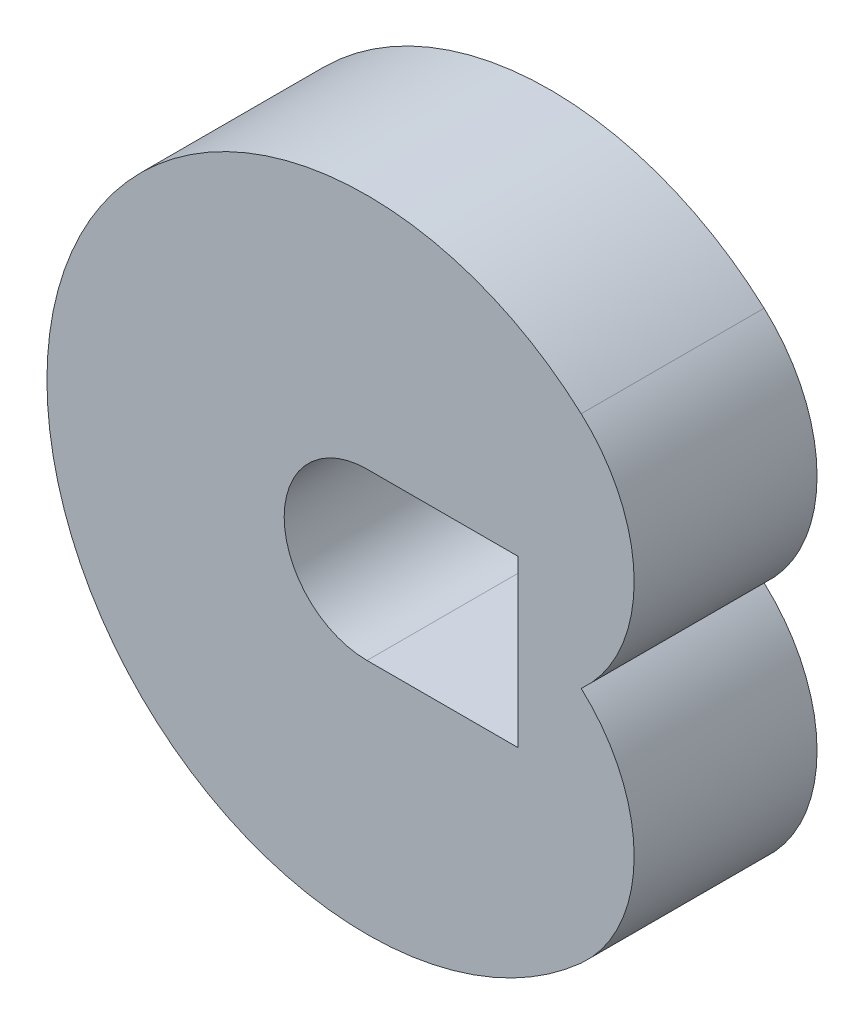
ISO-10303-21;
HEADER;
FILE_DESCRIPTION(('STEP AP214'),'2;1');
FILE_NAME('part.step','',(''),(''),'','','');
FILE_SCHEMA(('AUTOMOTIVE_DESIGN { 1 0 10303 214 1 1 1 1 }'));
ENDSEC;
DATA;
#1=APPLICATION_CONTEXT('core data for automotive mechanical design processes');
#2=APPLICATION_PROTOCOL_DEFINITION('international standard','automotive_design',2000,#1);
#3=PRODUCT_CONTEXT('',#1,'mechanical');
#4=PRODUCT('Part','Part','',(#3));
#5=PRODUCT_RELATED_PRODUCT_CATEGORY('part','',(#4));
#6=PRODUCT_DEFINITION_FORMATION('','',#4);
#7=PRODUCT_DEFINITION_CONTEXT('part definition',#1,'design');
#8=PRODUCT_DEFINITION('design','',#6,#7);
#9=PRODUCT_DEFINITION_SHAPE('','',#8);
#10=(LENGTH_UNIT() NAMED_UNIT(*) SI_UNIT(.MILLI.,.METRE.));
#11=(NAMED_UNIT(*) PLANE_ANGLE_UNIT() SI_UNIT($,.RADIAN.));
#12=(NAMED_UNIT(*) SI_UNIT($,.STERADIAN.) SOLID_ANGLE_UNIT());
#13=UNCERTAINTY_MEASURE_WITH_UNIT(LENGTH_MEASURE(1.E-05),#10,'distance_accuracy_value','');
#14=(GEOMETRIC_REPRESENTATION_CONTEXT(3) GLOBAL_UNCERTAINTY_ASSIGNED_CONTEXT((#13)) GLOBAL_UNIT_ASSIGNED_CONTEXT((#10,
#11,#12)) REPRESENTATION_CONTEXT('',''));
#15=CARTESIAN_POINT('',(0.,0.,0.));
#16=DIRECTION('',(0.,0.,1.));
#17=DIRECTION('',(1.,0.,0.));
#18=AXIS2_PLACEMENT_3D('',#15,#16,#17);
#19=CARTESIAN_POINT('',(234.195712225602,0.,400.));
#20=DIRECTION('',(0.,0.,-1.));
#21=DIRECTION('',(-1.,0.,0.));
#22=AXIS2_PLACEMENT_3D('',#19,#20,#21);
#23=PLANE('',#22);
#24=CARTESIAN_POINT('',(234.195712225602,260.100688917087,400.));
#25=DIRECTION('',(0.,0.,-1.));
#26=DIRECTION('',(-1.,0.,0.));
#27=AXIS2_PLACEMENT_3D('',#24,#25,#26);
#28=CIRCLE('',#27,350.);
#29=CARTESIAN_POINT('',(468.391424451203,520.201377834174,400.));
#30=VERTEX_POINT('',#29);
#31=CARTESIAN_POINT('',(468.391424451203,0.,400.));
#32=VERTEX_POINT('',#31);
#33=EDGE_CURVE('E155',#30,#32,#28,.T.);
#34=ORIENTED_EDGE('',*,*,#33,.F.);
#35=CARTESIAN_POINT('',(0.,0.,400.));
#36=DIRECTION('',(0.,0.,1.));
#37=DIRECTION('',(1.,0.,0.));
#38=AXIS2_PLACEMENT_3D('',#35,#36,#37);
#39=CIRCLE('',#38,700.);
#40=CARTESIAN_POINT('',(468.391424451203,-520.201377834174,400.));
#41=VERTEX_POINT('',#40);
#42=EDGE_CURVE('E161',#30,#41,#39,.T.);
#43=ORIENTED_EDGE('',*,*,#42,.T.);
#44=CARTESIAN_POINT('',(234.195712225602,-260.100688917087,400.));
#45=DIRECTION('',(0.,0.,1.));
#46=DIRECTION('',(1.,0.,0.));
#47=AXIS2_PLACEMENT_3D('',#44,#45,#46);
#48=CIRCLE('',#47,350.);
#49=EDGE_CURVE('E158',#41,#32,#48,.T.);
#50=ORIENTED_EDGE('',*,*,#49,.T.);
#51=EDGE_LOOP('',(#34,#43,#50));
#52=FACE_BOUND('',#51,.T.);
#53=CARTESIAN_POINT('',(0.,0.,400.));
#54=DIRECTION('',(0.,0.,1.));
#55=DIRECTION('',(1.,0.,0.));
#56=AXIS2_PLACEMENT_3D('',#53,#54,#55);
#57=CIRCLE('',#56,181.173331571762);
#58=CARTESIAN_POINT('',(0.,181.173331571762,400.));
#59=VERTEX_POINT('',#58);
#60=CARTESIAN_POINT('',(0.,-181.173331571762,400.));
#61=VERTEX_POINT('',#60);
#62=EDGE_CURVE('E118',#59,#61,#57,.T.);
#63=ORIENTED_EDGE('',*,*,#62,.F.);
#64=DIRECTION('',(1.,0.,0.));
#65=VECTOR('',#64,1.);
#66=CARTESIAN_POINT('',(0.,181.173331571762,400.));
#67=LINE('',#66,#65);
#68=CARTESIAN_POINT('',(330.,181.173331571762,400.));
#69=VERTEX_POINT('',#68);
#70=EDGE_CURVE('E140',#59,#69,#67,.T.);
#71=ORIENTED_EDGE('',*,*,#70,.T.);
#72=DIRECTION('',(0.,-1.,0.));
#73=VECTOR('',#72,1.);
#74=CARTESIAN_POINT('',(330.,181.173331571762,400.));
#75=LINE('',#74,#73);
#76=CARTESIAN_POINT('',(330.,-181.173331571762,400.));
#77=VERTEX_POINT('',#76);
#78=EDGE_CURVE('E77',#69,#77,#75,.T.);
#79=ORIENTED_EDGE('',*,*,#78,.T.);
#80=DIRECTION('',(-1.,0.,0.));
#81=VECTOR('',#80,1.);
#82=CARTESIAN_POINT('',(330.,-181.173331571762,400.));
#83=LINE('',#82,#81);
#84=EDGE_CURVE('E128',#77,#61,#83,.T.);
#85=ORIENTED_EDGE('',*,*,#84,.T.);
#86=EDGE_LOOP('',(#63,#71,#79,#85));
#87=FACE_BOUND('',#86,.T.);
#88=ADVANCED_FACE('F60',(#52,#87),#23,.F.);
#89=CARTESIAN_POINT('',(234.195712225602,0.,0.));
#90=DIRECTION('',(0.,0.,-1.));
#91=DIRECTION('',(-1.,0.,0.));
#92=AXIS2_PLACEMENT_3D('',#89,#90,#91);
#93=PLANE('',#92);
#94=CARTESIAN_POINT('',(234.195712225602,260.100688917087,0.));
#95=DIRECTION('',(0.,0.,-1.));
#96=DIRECTION('',(-1.,0.,0.));
#97=AXIS2_PLACEMENT_3D('',#94,#95,#96);
#98=CIRCLE('',#97,350.);
#99=CARTESIAN_POINT('',(468.391424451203,520.201377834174,0.));
#100=VERTEX_POINT('',#99);
#101=CARTESIAN_POINT('',(468.391424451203,0.,0.));
#102=VERTEX_POINT('',#101);
#103=EDGE_CURVE('E136',#100,#102,#98,.T.);
#104=ORIENTED_EDGE('',*,*,#103,.T.);
#105=CARTESIAN_POINT('',(234.195712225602,-260.100688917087,0.));
#106=DIRECTION('',(0.,0.,1.));
#107=DIRECTION('',(1.,0.,0.));
#108=AXIS2_PLACEMENT_3D('',#105,#106,#107);
#109=CIRCLE('',#108,350.);
#110=CARTESIAN_POINT('',(468.391424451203,-520.201377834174,0.));
#111=VERTEX_POINT('',#110);
#112=EDGE_CURVE('E165',#111,#102,#109,.T.);
#113=ORIENTED_EDGE('',*,*,#112,.F.);
#114=CARTESIAN_POINT('',(0.,0.,0.));
#115=DIRECTION('',(0.,0.,1.));
#116=DIRECTION('',(1.,0.,0.));
#117=AXIS2_PLACEMENT_3D('',#114,#115,#116);
#118=CIRCLE('',#117,700.);
#119=EDGE_CURVE('E159',#100,#111,#118,.T.);
#120=ORIENTED_EDGE('',*,*,#119,.F.);
#121=EDGE_LOOP('',(#104,#113,#120));
#122=FACE_BOUND('',#121,.T.);
#123=DIRECTION('',(1.,0.,0.));
#124=VECTOR('',#123,1.);
#125=CARTESIAN_POINT('',(0.,181.173331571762,0.));
#126=LINE('',#125,#124);
#127=CARTESIAN_POINT('',(0.,181.173331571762,0.));
#128=VERTEX_POINT('',#127);
#129=CARTESIAN_POINT('',(330.,181.173331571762,0.));
#130=VERTEX_POINT('',#129);
#131=EDGE_CURVE('E129',#128,#130,#126,.T.);
#132=ORIENTED_EDGE('',*,*,#131,.F.);
#133=CARTESIAN_POINT('',(0.,0.,0.));
#134=DIRECTION('',(0.,0.,1.));
#135=DIRECTION('',(1.,0.,0.));
#136=AXIS2_PLACEMENT_3D('',#133,#134,#135);
#137=CIRCLE('',#136,181.173331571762);
#138=CARTESIAN_POINT('',(0.,-181.173331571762,0.));
#139=VERTEX_POINT('',#138);
#140=EDGE_CURVE('E85',#128,#139,#137,.T.);
#141=ORIENTED_EDGE('',*,*,#140,.T.);
#142=DIRECTION('',(-1.,0.,0.));
#143=VECTOR('',#142,1.);
#144=CARTESIAN_POINT('',(330.,-181.173331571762,0.));
#145=LINE('',#144,#143);
#146=CARTESIAN_POINT('',(330.,-181.173331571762,0.));
#147=VERTEX_POINT('',#146);
#148=EDGE_CURVE('E135',#147,#139,#145,.T.);
#149=ORIENTED_EDGE('',*,*,#148,.F.);
#150=DIRECTION('',(0.,-1.,0.));
#151=VECTOR('',#150,1.);
#152=CARTESIAN_POINT('',(330.,181.173331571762,0.));
#153=LINE('',#152,#151);
#154=EDGE_CURVE('E146',#130,#147,#153,.T.);
#155=ORIENTED_EDGE('',*,*,#154,.F.);
#156=EDGE_LOOP('',(#132,#141,#149,#155));
#157=FACE_BOUND('',#156,.T.);
#158=ADVANCED_FACE('F180',(#122,#157),#93,.T.);
#159=CARTESIAN_POINT('',(234.195712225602,260.100688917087,400.));
#160=DIRECTION('',(0.,0.,-1.));
#161=DIRECTION('',(-1.,0.,0.));
#162=AXIS2_PLACEMENT_3D('',#159,#160,#161);
#163=CYLINDRICAL_SURFACE('',#162,350.);
#164=ORIENTED_EDGE('',*,*,#103,.F.);
#165=DIRECTION('',(0.,0.,-1.));
#166=VECTOR('',#165,1.);
#167=CARTESIAN_POINT('',(468.391424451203,520.201377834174,400.));
#168=LINE('',#167,#166);
#169=EDGE_CURVE('E12',#30,#100,#168,.T.);
#170=ORIENTED_EDGE('',*,*,#169,.F.);
#171=ORIENTED_EDGE('',*,*,#33,.T.);
#172=DIRECTION('',(0.,0.,-1.));
#173=VECTOR('',#172,1.);
#174=CARTESIAN_POINT('',(468.391424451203,0.,400.));
#175=LINE('',#174,#173);
#176=EDGE_CURVE('E64',#32,#102,#175,.T.);
#177=ORIENTED_EDGE('',*,*,#176,.T.);
#178=EDGE_LOOP('',(#164,#170,#171,#177));
#179=FACE_BOUND('',#178,.T.);
#180=ADVANCED_FACE('F62',(#179),#163,.T.);
#181=CARTESIAN_POINT('',(0.,0.,400.));
#182=DIRECTION('',(0.,0.,-1.));
#183=DIRECTION('',(-1.,0.,0.));
#184=AXIS2_PLACEMENT_3D('',#181,#182,#183);
#185=CYLINDRICAL_SURFACE('',#184,700.);
#186=ORIENTED_EDGE('',*,*,#119,.T.);
#187=DIRECTION('',(0.,0.,-1.));
#188=VECTOR('',#187,1.);
#189=CARTESIAN_POINT('',(468.391424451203,-520.201377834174,400.));
#190=LINE('',#189,#188);
#191=EDGE_CURVE('E69',#41,#111,#190,.T.);
#192=ORIENTED_EDGE('',*,*,#191,.F.);
#193=ORIENTED_EDGE('',*,*,#42,.F.);
#194=ORIENTED_EDGE('',*,*,#169,.T.);
#195=EDGE_LOOP('',(#186,#192,#193,#194));
#196=FACE_BOUND('',#195,.T.);
#197=ADVANCED_FACE('F183',(#196),#185,.T.);
#198=CARTESIAN_POINT('',(234.195712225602,-260.100688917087,400.));
#199=DIRECTION('',(0.,0.,-1.));
#200=DIRECTION('',(-1.,0.,0.));
#201=AXIS2_PLACEMENT_3D('',#198,#199,#200);
#202=CYLINDRICAL_SURFACE('',#201,350.);
#203=ORIENTED_EDGE('',*,*,#112,.T.);
#204=ORIENTED_EDGE('',*,*,#176,.F.);
#205=ORIENTED_EDGE('',*,*,#49,.F.);
#206=ORIENTED_EDGE('',*,*,#191,.T.);
#207=EDGE_LOOP('',(#203,#204,#205,#206));
#208=FACE_BOUND('',#207,.T.);
#209=ADVANCED_FACE('F177',(#208),#202,.T.);
#210=CARTESIAN_POINT('',(0.,0.,400.));
#211=DIRECTION('',(0.,0.,-1.));
#212=DIRECTION('',(-1.,0.,0.));
#213=AXIS2_PLACEMENT_3D('',#210,#211,#212);
#214=CYLINDRICAL_SURFACE('',#213,181.173331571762);
#215=ORIENTED_EDGE('',*,*,#140,.F.);
#216=DIRECTION('',(0.,0.,-1.));
#217=VECTOR('',#216,1.);
#218=CARTESIAN_POINT('',(0.,181.173331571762,400.));
#219=LINE('',#218,#217);
#220=EDGE_CURVE('E123',#59,#128,#219,.T.);
#221=ORIENTED_EDGE('',*,*,#220,.F.);
#222=ORIENTED_EDGE('',*,*,#62,.T.);
#223=DIRECTION('',(0.,0.,-1.));
#224=VECTOR('',#223,1.);
#225=CARTESIAN_POINT('',(0.,-181.173331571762,400.));
#226=LINE('',#225,#224);
#227=EDGE_CURVE('E121',#61,#139,#226,.T.);
#228=ORIENTED_EDGE('',*,*,#227,.T.);
#229=EDGE_LOOP('',(#215,#221,#222,#228));
#230=FACE_BOUND('',#229,.T.);
#231=ADVANCED_FACE('F120',(#230),#214,.F.);
#232=CARTESIAN_POINT('',(330.,-181.173331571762,400.));
#233=DIRECTION('',(0.,-1.,0.));
#234=DIRECTION('',(1.,0.,0.));
#235=AXIS2_PLACEMENT_3D('',#232,#233,#234);
#236=PLANE('',#235);
#237=ORIENTED_EDGE('',*,*,#148,.T.);
#238=ORIENTED_EDGE('',*,*,#227,.F.);
#239=ORIENTED_EDGE('',*,*,#84,.F.);
#240=DIRECTION('',(0.,0.,-1.));
#241=VECTOR('',#240,1.);
#242=CARTESIAN_POINT('',(330.,-181.173331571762,400.));
#243=LINE('',#242,#241);
#244=EDGE_CURVE('E137',#77,#147,#243,.T.);
#245=ORIENTED_EDGE('',*,*,#244,.T.);
#246=EDGE_LOOP('',(#237,#238,#239,#245));
#247=FACE_BOUND('',#246,.T.);
#248=ADVANCED_FACE('F133',(#247),#236,.F.);
#249=CARTESIAN_POINT('',(330.,181.173331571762,400.));
#250=DIRECTION('',(1.,0.,0.));
#251=DIRECTION('',(0.,0.,-1.));
#252=AXIS2_PLACEMENT_3D('',#249,#250,#251);
#253=PLANE('',#252);
#254=ORIENTED_EDGE('',*,*,#154,.T.);
#255=ORIENTED_EDGE('',*,*,#244,.F.);
#256=ORIENTED_EDGE('',*,*,#78,.F.);
#257=DIRECTION('',(0.,0.,-1.));
#258=VECTOR('',#257,1.);
#259=CARTESIAN_POINT('',(330.,181.173331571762,400.));
#260=LINE('',#259,#258);
#261=EDGE_CURVE('E152',#69,#130,#260,.T.);
#262=ORIENTED_EDGE('',*,*,#261,.T.);
#263=EDGE_LOOP('',(#254,#255,#256,#262));
#264=FACE_BOUND('',#263,.T.);
#265=ADVANCED_FACE('F203',(#264),#253,.F.);
#266=CARTESIAN_POINT('',(0.,181.173331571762,400.));
#267=DIRECTION('',(0.,1.,0.));
#268=DIRECTION('',(-1.,0.,0.));
#269=AXIS2_PLACEMENT_3D('',#266,#267,#268);
#270=PLANE('',#269);
#271=ORIENTED_EDGE('',*,*,#131,.T.);
#272=ORIENTED_EDGE('',*,*,#261,.F.);
#273=ORIENTED_EDGE('',*,*,#70,.F.);
#274=ORIENTED_EDGE('',*,*,#220,.T.);
#275=EDGE_LOOP('',(#271,#272,#273,#274));
#276=FACE_BOUND('',#275,.T.);
#277=ADVANCED_FACE('F207',(#276),#270,.F.);
#278=CLOSED_SHELL('',(#88,#158,#180,#197,#209,#231,#248,#265,#277));
#279=MANIFOLD_SOLID_BREP('B2',#278);
#280=ADVANCED_BREP_SHAPE_REPRESENTATION('',(#18,#279),#14);
#281=SHAPE_DEFINITION_REPRESENTATION(#9,#280);
ENDSEC;
END-ISO-10303-21;
